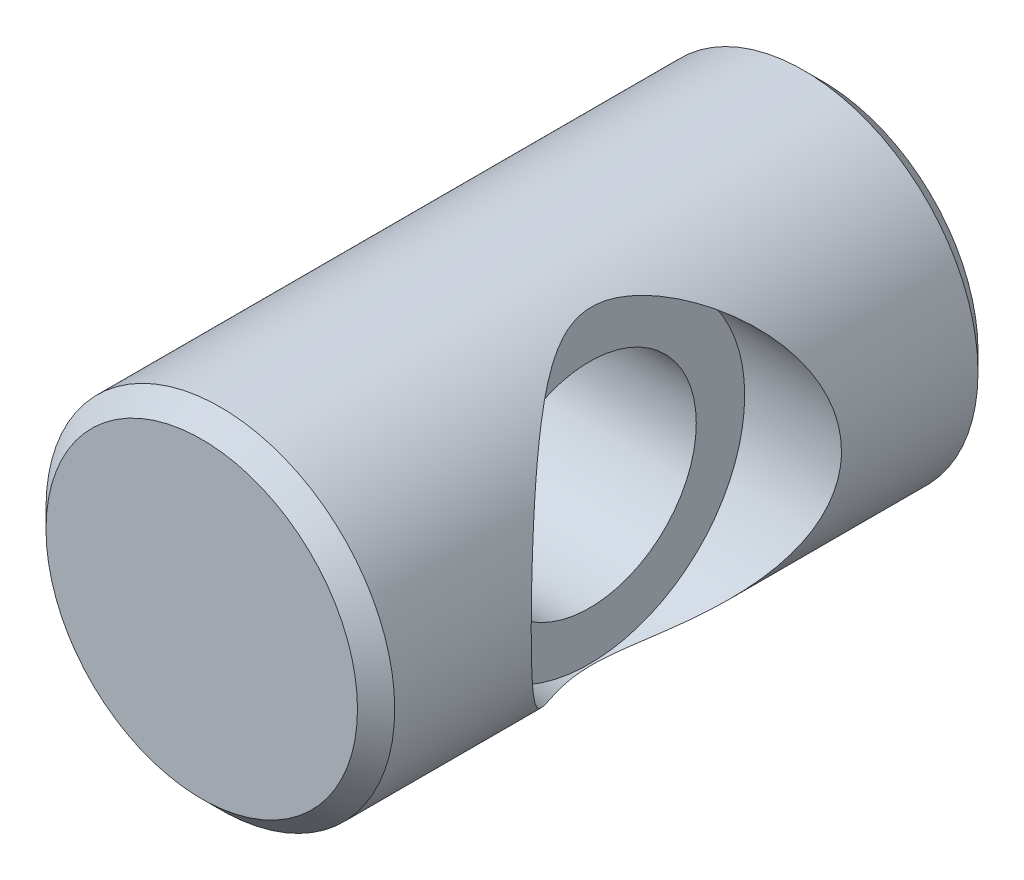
ISO-10303-21;
HEADER;
FILE_DESCRIPTION(('STEP AP214'),'2;1');
FILE_NAME('part.step','',(''),(''),'','','');
FILE_SCHEMA(('AUTOMOTIVE_DESIGN { 1 0 10303 214 1 1 1 1 }'));
ENDSEC;
DATA;
#1=APPLICATION_CONTEXT('core data for automotive mechanical design processes');
#2=APPLICATION_PROTOCOL_DEFINITION('international standard','automotive_design',2000,#1);
#3=PRODUCT_CONTEXT('',#1,'mechanical');
#4=PRODUCT('Part','Part','',(#3));
#5=PRODUCT_RELATED_PRODUCT_CATEGORY('part','',(#4));
#6=PRODUCT_DEFINITION_FORMATION('','',#4);
#7=PRODUCT_DEFINITION_CONTEXT('part definition',#1,'design');
#8=PRODUCT_DEFINITION('design','',#6,#7);
#9=PRODUCT_DEFINITION_SHAPE('','',#8);
#10=(LENGTH_UNIT() NAMED_UNIT(*) SI_UNIT(.MILLI.,.METRE.));
#11=(NAMED_UNIT(*) PLANE_ANGLE_UNIT() SI_UNIT($,.RADIAN.));
#12=(NAMED_UNIT(*) SI_UNIT($,.STERADIAN.) SOLID_ANGLE_UNIT());
#13=UNCERTAINTY_MEASURE_WITH_UNIT(LENGTH_MEASURE(1.E-05),#10,'distance_accuracy_value','');
#14=(GEOMETRIC_REPRESENTATION_CONTEXT(3) GLOBAL_UNCERTAINTY_ASSIGNED_CONTEXT((#13)) GLOBAL_UNIT_ASSIGNED_CONTEXT((#10,
#11,#12)) REPRESENTATION_CONTEXT('',''));
#15=CARTESIAN_POINT('',(0.,0.,0.));
#16=DIRECTION('',(0.,0.,1.));
#17=DIRECTION('',(1.,0.,0.));
#18=AXIS2_PLACEMENT_3D('',#15,#16,#17);
#19=CARTESIAN_POINT('',(0.,0.,12.7));
#20=DIRECTION('',(0.,0.,-1.));
#21=DIRECTION('',(-1.,0.,0.));
#22=AXIS2_PLACEMENT_3D('',#19,#20,#21);
#23=CYLINDRICAL_SURFACE('',#22,7.1374);
#24=CARTESIAN_POINT('',(0.,0.,11.938));
#25=DIRECTION('',(0.,0.,1.));
#26=DIRECTION('',(1.,0.,0.));
#27=AXIS2_PLACEMENT_3D('',#24,#25,#26);
#28=CIRCLE('',#27,7.1374);
#29=CARTESIAN_POINT('',(7.1374,0.,11.938));
#30=VERTEX_POINT('',#29);
#31=EDGE_CURVE('E89',#30,#30,#28,.F.);
#32=ORIENTED_EDGE('',*,*,#31,.T.);
#33=EDGE_LOOP('',(#32));
#34=FACE_BOUND('',#33,.T.);
#35=CARTESIAN_POINT('',(0.,0.,-11.938));
#36=DIRECTION('',(0.,0.,1.));
#37=DIRECTION('',(1.,0.,0.));
#38=AXIS2_PLACEMENT_3D('',#35,#36,#37);
#39=CIRCLE('',#38,7.1374);
#40=CARTESIAN_POINT('',(7.1374,0.,-11.938));
#41=VERTEX_POINT('',#40);
#42=EDGE_CURVE('E92',#41,#41,#39,.T.);
#43=ORIENTED_EDGE('',*,*,#42,.T.);
#44=EDGE_LOOP('',(#43));
#45=FACE_BOUND('',#44,.T.);
#46=CARTESIAN_POINT('',(-7.1374,0.,4.3688));
#47=CARTESIAN_POINT('',(-7.13739926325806,-0.111430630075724,4.36879921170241));
#48=CARTESIAN_POINT('',(-7.13478403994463,-0.222878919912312,4.36453032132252));
#49=CARTESIAN_POINT('',(-7.12438669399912,-0.444927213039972,4.3475124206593));
#50=CARTESIAN_POINT('',(-7.11660192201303,-0.555526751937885,4.33475906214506));
#51=CARTESIAN_POINT('',(-7.09603926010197,-0.775166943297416,4.30091740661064));
#52=CARTESIAN_POINT('',(-7.08325306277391,-0.884204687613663,4.279815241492));
#53=CARTESIAN_POINT('',(-7.05300479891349,-1.09976323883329,4.22956341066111));
#54=CARTESIAN_POINT('',(-7.0355407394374,-1.20628295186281,4.20041031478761));
#55=CARTESIAN_POINT('',(-6.97692189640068,-1.51984647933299,4.10173340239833));
#56=CARTESIAN_POINT('',(-6.9294069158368,-1.72224170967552,4.02077902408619));
#57=CARTESIAN_POINT('',(-6.82142507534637,-2.10979880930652,3.83168041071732));
#58=CARTESIAN_POINT('',(-6.76096055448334,-2.29496378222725,3.72354108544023));
#59=CARTESIAN_POINT('',(-6.62654033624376,-2.6593213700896,3.47374909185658));
#60=CARTESIAN_POINT('',(-6.55189961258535,-2.83691659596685,3.33013791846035));
#61=CARTESIAN_POINT('',(-6.39886499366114,-3.16704970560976,3.0179360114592));
#62=CARTESIAN_POINT('',(-6.32046626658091,-3.31955414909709,2.84931250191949));
#63=CARTESIAN_POINT('',(-6.15672694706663,-3.6151388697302,2.46637660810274));
#64=CARTESIAN_POINT('',(-6.07179226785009,-3.75447742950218,2.24897696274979));
#65=CARTESIAN_POINT('',(-5.91688504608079,-3.99416961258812,1.78885953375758));
#66=CARTESIAN_POINT('',(-5.84688778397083,-4.09458787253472,1.54618458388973));
#67=CARTESIAN_POINT('',(-5.74815230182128,-4.23160691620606,1.10419381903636));
#68=CARTESIAN_POINT('',(-5.71347354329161,-4.27788724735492,0.909212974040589));
#69=CARTESIAN_POINT('',(-5.66392535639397,-4.34329069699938,0.512386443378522));
#70=CARTESIAN_POINT('',(-5.64902972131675,-4.36244974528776,0.310550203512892));
#71=CARTESIAN_POINT('',(-5.64126890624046,-4.37248425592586,-0.0947216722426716));
#72=CARTESIAN_POINT('',(-5.64845360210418,-4.36329568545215,-0.29815989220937));
#73=CARTESIAN_POINT('',(-5.68383016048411,-4.31709944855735,-0.700035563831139));
#74=CARTESIAN_POINT('',(-5.71203835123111,-4.28007015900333,-0.898469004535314));
#75=CARTESIAN_POINT('',(-5.78483926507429,-4.18111909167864,-1.28188424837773));
#76=CARTESIAN_POINT('',(-5.82913703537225,-4.11964364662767,-1.46704052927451));
#77=CARTESIAN_POINT('',(-5.92929954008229,-3.97412459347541,-1.82485398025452));
#78=CARTESIAN_POINT('',(-5.98516843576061,-3.89007286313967,-1.99750662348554));
#79=CARTESIAN_POINT('',(-6.11436811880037,-3.6843267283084,-2.35856047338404));
#80=CARTESIAN_POINT('',(-6.18902987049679,-3.55857441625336,-2.54416749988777));
#81=CARTESIAN_POINT('',(-6.34072132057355,-3.28066897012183,-2.89370006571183));
#82=CARTESIAN_POINT('',(-6.41775330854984,-3.12848960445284,-3.05760377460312));
#83=CARTESIAN_POINT('',(-6.53594550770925,-2.86962657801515,-3.29670389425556));
#84=CARTESIAN_POINT('',(-6.57847668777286,-2.77098301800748,-3.38006303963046));
#85=CARTESIAN_POINT('',(-6.66107998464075,-2.56606243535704,-3.53814479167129));
#86=CARTESIAN_POINT('',(-6.70115302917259,-2.45978832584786,-3.61287066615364));
#87=CARTESIAN_POINT('',(-6.77776807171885,-2.24006284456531,-3.75306802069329));
#88=CARTESIAN_POINT('',(-6.81430940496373,-2.12661012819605,-3.81853775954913));
#89=CARTESIAN_POINT('',(-6.88279796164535,-1.89323624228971,-3.93945740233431));
#90=CARTESIAN_POINT('',(-6.91474801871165,-1.77331912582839,-3.99491349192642));
#91=CARTESIAN_POINT('',(-6.97140079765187,-1.53497962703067,-4.09216716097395));
#92=CARTESIAN_POINT('',(-6.99641848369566,-1.41688139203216,-4.13457466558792));
#93=CARTESIAN_POINT('',(-7.04081739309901,-1.17655725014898,-4.20926915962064));
#94=CARTESIAN_POINT('',(-7.06020182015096,-1.05433373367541,-4.24156190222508));
#95=CARTESIAN_POINT('',(-7.09274558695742,-0.806847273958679,-4.2955136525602));
#96=CARTESIAN_POINT('',(-7.10590996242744,-0.68158687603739,-4.31718126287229));
#97=CARTESIAN_POINT('',(-7.12561096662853,-0.429145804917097,-4.34953245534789));
#98=CARTESIAN_POINT('',(-7.13214862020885,-0.301965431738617,-4.36021773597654));
#99=CARTESIAN_POINT('',(-7.13794134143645,-0.0651494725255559,-4.36968533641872));
#100=CARTESIAN_POINT('',(-7.1381001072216,0.0444082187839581,-4.36994470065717));
#101=CARTESIAN_POINT('',(-7.13338600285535,0.263161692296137,-4.36224027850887));
#102=CARTESIAN_POINT('',(-7.12851158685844,0.372357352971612,-4.35427396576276));
#103=CARTESIAN_POINT('',(-7.11384783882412,0.589470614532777,-4.33022606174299));
#104=CARTESIAN_POINT('',(-7.10406065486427,0.697388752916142,-4.31414801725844));
#105=CARTESIAN_POINT('',(-7.07981255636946,0.911230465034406,-4.27409964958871));
#106=CARTESIAN_POINT('',(-7.06534984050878,1.0171532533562,-4.2501262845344));
#107=CARTESIAN_POINT('',(-7.01646831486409,1.32421326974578,-4.16853283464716));
#108=CARTESIAN_POINT('',(-6.97603776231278,1.52172435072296,-4.10041676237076));
#109=CARTESIAN_POINT('',(-6.88203279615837,1.90227849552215,-3.93835542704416));
#110=CARTESIAN_POINT('',(-6.82845599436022,2.08531892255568,-3.8444054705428));
#111=CARTESIAN_POINT('',(-6.70596969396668,2.45225584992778,-3.62262231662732));
#112=CARTESIAN_POINT('',(-6.6360505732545,2.63430931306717,-3.49230007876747));
#113=CARTESIAN_POINT('',(-6.49034671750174,2.97529044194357,-3.20680766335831));
#114=CARTESIAN_POINT('',(-6.41455531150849,3.13419119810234,-3.0516090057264));
#115=CARTESIAN_POINT('',(-6.25266900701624,3.44698224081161,-2.69597729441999));
#116=CARTESIAN_POINT('',(-6.16659291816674,3.5971673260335,-2.49225811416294));
#117=CARTESIAN_POINT('',(-6.00460677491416,3.86150634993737,-2.05898797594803));
#118=CARTESIAN_POINT('',(-5.92868769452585,3.97569240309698,-1.82946029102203));
#119=CARTESIAN_POINT('',(-5.81234039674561,4.14334349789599,-1.4000867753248));
#120=CARTESIAN_POINT('',(-5.76779379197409,4.20457409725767,-1.20440352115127));
#121=CARTESIAN_POINT('',(-5.69758785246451,4.29924496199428,-0.80326067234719));
#122=CARTESIAN_POINT('',(-5.67190057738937,4.33272634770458,-0.597816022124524));
#123=CARTESIAN_POINT('',(-5.64321310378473,4.37003861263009,-0.181630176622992));
#124=CARTESIAN_POINT('',(-5.64031853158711,4.37373144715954,0.0291311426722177));
#125=CARTESIAN_POINT('',(-5.65799816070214,4.35082899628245,0.448046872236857));
#126=CARTESIAN_POINT('',(-5.67858319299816,4.32421973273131,0.656200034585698));
#127=CARTESIAN_POINT('',(-5.73795877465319,4.24505718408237,1.05064162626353));
#128=CARTESIAN_POINT('',(-5.77551626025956,4.19425020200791,1.2374804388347));
#129=CARTESIAN_POINT('',(-5.86388187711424,4.06978791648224,1.60000573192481));
#130=CARTESIAN_POINT('',(-5.91469515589,3.99612373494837,1.77568784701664));
#131=CARTESIAN_POINT('',(-6.03314781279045,3.8153536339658,2.13931949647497));
#132=CARTESIAN_POINT('',(-6.10216834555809,3.70488500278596,2.32514235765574));
#133=CARTESIAN_POINT('',(-6.24489624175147,3.45890667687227,2.67743124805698));
#134=CARTESIAN_POINT('',(-6.31860745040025,3.32337625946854,2.84388107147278));
#135=CARTESIAN_POINT('',(-6.47808979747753,3.00238753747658,3.18370728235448));
#136=CARTESIAN_POINT('',(-6.56364043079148,2.8123331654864,3.35292631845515));
#137=CARTESIAN_POINT('',(-6.68412541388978,2.50541943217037,3.58128590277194));
#138=CARTESIAN_POINT('',(-6.72301072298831,2.39937413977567,3.65321251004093));
#139=CARTESIAN_POINT('',(-6.79715906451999,2.1804647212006,3.78793859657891));
#140=CARTESIAN_POINT('',(-6.83242407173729,2.06760436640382,3.85074305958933));
#141=CARTESIAN_POINT('',(-6.89785133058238,1.83745076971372,3.96566288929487));
#142=CARTESIAN_POINT('',(-6.92808339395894,1.72025176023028,4.01792708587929));
#143=CARTESIAN_POINT('',(-6.98320798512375,1.48066798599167,4.11224920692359));
#144=CARTESIAN_POINT('',(-7.00810362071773,1.35828628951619,4.15431307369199));
#145=CARTESIAN_POINT('',(-7.0517460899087,1.10961591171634,4.22751922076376));
#146=CARTESIAN_POINT('',(-7.07051025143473,0.983339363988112,4.25869229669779));
#147=CARTESIAN_POINT('',(-7.10136144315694,0.727791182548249,4.30971981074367));
#148=CARTESIAN_POINT('',(-7.11345373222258,0.598521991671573,4.32958316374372));
#149=CARTESIAN_POINT('',(-7.12712117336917,0.390761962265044,4.35199151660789));
#150=CARTESIAN_POINT('',(-7.1309708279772,0.312801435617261,4.35828981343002));
#151=CARTESIAN_POINT('',(-7.13611056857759,0.156563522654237,4.36669444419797));
#152=CARTESIAN_POINT('',(-7.13740051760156,0.0782861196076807,4.36880055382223));
#153=CARTESIAN_POINT('',(-7.1374,0.,4.3688));
#154=B_SPLINE_CURVE_WITH_KNOTS('',3,(#46,#47,#48,#49,#50,#51,#52,#53,#54,#55,#56,#57,#58,#59,
#60,#61,#62,#63,#64,#65,#66,#67,#68,#69,#70,#71,#72,#73,#74,#75,#76,#77,#78,#79,#80,#81,#82,#83,
#84,#85,#86,#87,#88,#89,#90,#91,#92,#93,#94,#95,#96,#97,#98,#99,#100,#101,#102,#103,#104,#105,
#106,#107,#108,#109,#110,#111,#112,#113,#114,#115,#116,#117,#118,#119,#120,#121,#122,#123,#124,
#125,#126,#127,#128,#129,#130,#131,#132,#133,#134,#135,#136,#137,#138,#139,#140,#141,#142,#143,
#144,#145,#146,#147,#148,#149,#150,#151,#152,#153),.UNSPECIFIED.,.T.,.F.,(4,2,2,2,2,2,2,2,2,2,2,
2,2,2,2,2,2,2,2,2,2,2,2,2,2,2,2,2,2,2,2,2,2,2,2,2,2,2,2,2,2,2,2,2,2,2,2,2,2,2,2,2,2,4),(0.,
0.334210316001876,0.668592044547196,1.00353155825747,1.33861399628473,2.00472075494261,
2.67070729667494,3.3887362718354,4.10771459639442,4.91926664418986,5.7294650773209,
6.33703528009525,6.94379982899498,7.55193596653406,8.1605449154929,8.75851775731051,
9.35670601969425,10.0630177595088,10.7700346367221,11.1775127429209,11.5848361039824,
11.992235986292,12.3993833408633,12.7826735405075,13.165745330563,13.5485064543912,
13.931208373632,14.2594681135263,14.5878287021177,14.9160458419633,15.2443895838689,
15.8798983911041,16.5155227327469,17.2164321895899,17.9181498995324,18.716527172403,
19.5141901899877,20.1411179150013,20.7671149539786,21.3960113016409,22.0251978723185,
22.6146121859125,23.2042557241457,23.882548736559,24.5614051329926,25.3625985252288,
25.763895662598,26.1649727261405,26.5599138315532,26.9546243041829,27.3482094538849,
27.7414839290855,27.9762724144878,28.2110734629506),.UNSPECIFIED.);
#155=CARTESIAN_POINT('',(-7.1374,0.,4.3688));
#156=VERTEX_POINT('',#155);
#157=EDGE_CURVE('E41',#156,#156,#154,.T.);
#158=ORIENTED_EDGE('',*,*,#157,.T.);
#159=EDGE_LOOP('',(#158));
#160=FACE_BOUND('',#159,.T.);
#161=CARTESIAN_POINT('',(7.1374,0.,6.35));
#162=CARTESIAN_POINT('',(7.13739876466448,-0.147620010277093,6.34999874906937));
#163=CARTESIAN_POINT('',(7.13281010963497,-0.295262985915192,6.34484230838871));
#164=CARTESIAN_POINT('',(7.11455464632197,-0.589334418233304,6.32431265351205));
#165=CARTESIAN_POINT('',(7.10088293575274,-0.73576217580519,6.30893392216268));
#166=CARTESIAN_POINT('',(7.06473743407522,-1.02637136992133,6.26822336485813));
#167=CARTESIAN_POINT('',(7.04224908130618,-1.17054867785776,6.24287507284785));
#168=CARTESIAN_POINT('',(6.98894287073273,-1.4553925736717,6.18268055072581));
#169=CARTESIAN_POINT('',(6.95812110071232,-1.59605747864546,6.14782985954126));
#170=CARTESIAN_POINT('',(6.88901812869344,-1.8718887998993,6.06950822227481));
#171=CARTESIAN_POINT('',(6.85079387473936,-2.00708822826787,6.02610304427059));
#172=CARTESIAN_POINT('',(6.7674199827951,-2.27241716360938,5.93114720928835));
#173=CARTESIAN_POINT('',(6.72226730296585,-2.40254441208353,5.87959297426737));
#174=CARTESIAN_POINT('',(6.57751191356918,-2.78437509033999,5.71372273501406));
#175=CARTESIAN_POINT('',(6.46854341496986,-3.02779231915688,5.58812218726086));
#176=CARTESIAN_POINT('',(6.26756942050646,-3.41948638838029,5.35395838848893));
#177=CARTESIAN_POINT('',(6.18042092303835,-3.57425087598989,5.25175506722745));
#178=CARTESIAN_POINT('',(5.99868531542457,-3.87150538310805,5.03662253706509));
#179=CARTESIAN_POINT('',(5.90409801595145,-4.01399509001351,4.92369305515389));
#180=CARTESIAN_POINT('',(5.70901937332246,-4.28693376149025,4.6879967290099));
#181=CARTESIAN_POINT('',(5.60851425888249,-4.41735266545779,4.56520667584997));
#182=CARTESIAN_POINT('',(5.40351880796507,-4.66587598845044,4.31088239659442));
#183=CARTESIAN_POINT('',(5.29902900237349,-4.78398204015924,4.17934933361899));
#184=CARTESIAN_POINT('',(5.08539551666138,-5.01059065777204,3.9049788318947));
#185=CARTESIAN_POINT('',(4.97620002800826,-5.11881590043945,3.76195311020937));
#186=CARTESIAN_POINT('',(4.75744105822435,-5.32274271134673,3.46742125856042));
#187=CARTESIAN_POINT('',(4.64787747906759,-5.41844061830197,3.31591266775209));
#188=CARTESIAN_POINT('',(4.43107203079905,-5.59712069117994,3.00448360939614));
#189=CARTESIAN_POINT('',(4.3238262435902,-5.6801260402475,2.84457921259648));
#190=CARTESIAN_POINT('',(4.11477697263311,-5.83333959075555,2.51546828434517));
#191=CARTESIAN_POINT('',(4.01296974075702,-5.90355668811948,2.34626832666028));
#192=CARTESIAN_POINT('',(3.81848747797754,-6.03119062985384,1.99559879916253));
#193=CARTESIAN_POINT('',(3.72590887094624,-6.08847892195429,1.81402754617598));
#194=CARTESIAN_POINT('',(3.55841845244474,-6.18785972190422,1.43889571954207));
#195=CARTESIAN_POINT('',(3.48348141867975,-6.22997397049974,1.24535276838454));
#196=CARTESIAN_POINT('',(3.37167556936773,-6.29108197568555,0.879335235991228));
#197=CARTESIAN_POINT('',(3.33056517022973,-6.31274439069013,0.70865514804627));
#198=CARTESIAN_POINT('',(3.27444959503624,-6.3420450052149,0.362001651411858));
#199=CARTESIAN_POINT('',(3.25938666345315,-6.34971423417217,0.186040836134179));
#200=CARTESIAN_POINT('',(3.25830440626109,-6.35027073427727,-0.166494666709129));
#201=CARTESIAN_POINT('',(3.27236800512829,-6.34311580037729,-0.343069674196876));
#202=CARTESIAN_POINT('',(3.32682908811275,-6.31470835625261,-0.691090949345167));
#203=CARTESIAN_POINT('',(3.36728310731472,-6.293425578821,-0.86252537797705));
#204=CARTESIAN_POINT('',(3.45568072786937,-6.24520640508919,-1.15598941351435));
#205=CARTESIAN_POINT('',(3.49935461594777,-6.22093647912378,-1.27982459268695));
#206=CARTESIAN_POINT('',(3.595296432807,-6.16598571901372,-1.52270256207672));
#207=CARTESIAN_POINT('',(3.64756969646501,-6.13530090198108,-1.64174231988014));
#208=CARTESIAN_POINT('',(3.75856141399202,-6.06794198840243,-1.87548146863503));
#209=CARTESIAN_POINT('',(3.81730041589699,-6.03124860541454,-1.99016536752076));
#210=CARTESIAN_POINT('',(3.93928603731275,-5.95229351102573,-2.21515487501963));
#211=CARTESIAN_POINT('',(4.00253427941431,-5.91002979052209,-2.3254588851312));
#212=CARTESIAN_POINT('',(4.18078734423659,-5.7864061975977,-2.62339918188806));
#213=CARTESIAN_POINT('',(4.29897126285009,-5.69953206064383,-2.80686361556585));
#214=CARTESIAN_POINT('',(4.53936837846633,-5.51000260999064,-3.16275382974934));
#215=CARTESIAN_POINT('',(4.66158425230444,-5.40733663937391,-3.33517204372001));
#216=CARTESIAN_POINT('',(4.90624682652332,-5.18636542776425,-3.6693605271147));
#217=CARTESIAN_POINT('',(5.02869339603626,-5.06806734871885,-3.83113562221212));
#218=CARTESIAN_POINT('',(5.270889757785,-4.81568203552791,-4.14391911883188));
#219=CARTESIAN_POINT('',(5.39064071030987,-4.68160175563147,-4.29493221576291));
#220=CARTESIAN_POINT('',(5.60292447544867,-4.4240358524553,-4.55824969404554));
#221=CARTESIAN_POINT('',(5.69634947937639,-4.30328021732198,-4.67250167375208));
#222=CARTESIAN_POINT('',(5.87838071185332,-4.05109205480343,-4.89277218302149));
#223=CARTESIAN_POINT('',(5.96698576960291,-3.9196569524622,-4.99878871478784));
#224=CARTESIAN_POINT('',(6.22315124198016,-3.50974788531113,-5.30279179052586));
#225=CARTESIAN_POINT('',(6.38160503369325,-3.21503076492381,-5.48739550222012));
#226=CARTESIAN_POINT('',(6.63204370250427,-2.65184233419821,-5.77650546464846));
#227=CARTESIAN_POINT('',(6.7309989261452,-2.39097113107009,-5.88969390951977));
#228=CARTESIAN_POINT('',(6.85760721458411,-1.98392745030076,-6.03384771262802));
#229=CARTESIAN_POINT('',(6.896180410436,-1.84558185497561,-6.07763630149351));
#230=CARTESIAN_POINT('',(6.96534900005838,-1.56439138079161,-6.15600921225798));
#231=CARTESIAN_POINT('',(6.99594785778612,-1.42154848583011,-6.19059753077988));
#232=CARTESIAN_POINT('',(7.04872964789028,-1.1312832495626,-6.2501842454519));
#233=CARTESIAN_POINT('',(7.07085321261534,-0.983836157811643,-6.27511500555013));
#234=CARTESIAN_POINT('',(7.10588886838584,-0.686462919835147,-6.31456731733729));
#235=CARTESIAN_POINT('',(7.11880093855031,-0.536536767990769,-6.32908884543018));
#236=CARTESIAN_POINT('',(7.13510289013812,-0.235564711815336,-6.34741932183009));
#237=CARTESIAN_POINT('',(7.13849604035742,-0.0845192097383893,-6.35123194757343));
#238=CARTESIAN_POINT('',(7.13568582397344,0.217361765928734,-6.34807326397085));
#239=CARTESIAN_POINT('',(7.12948322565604,0.368197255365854,-6.3411028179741));
#240=CARTESIAN_POINT('',(7.10878875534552,0.652476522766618,-6.31782583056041));
#241=CARTESIAN_POINT('',(7.09523903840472,0.786078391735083,-6.3025802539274));
#242=CARTESIAN_POINT('',(7.06083548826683,1.05116656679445,-6.26382460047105));
#243=CARTESIAN_POINT('',(7.03997925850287,1.18265216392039,-6.24031181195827));
#244=CARTESIAN_POINT('',(6.99133878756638,1.44261523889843,-6.18538619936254));
#245=CARTESIAN_POINT('',(6.96355641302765,1.57109351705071,-6.15397550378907));
#246=CARTESIAN_POINT('',(6.90152346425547,1.82441455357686,-6.08369277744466));
#247=CARTESIAN_POINT('',(6.86727044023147,1.94925591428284,-6.04481792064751));
#248=CARTESIAN_POINT('',(6.75240358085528,2.32784464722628,-5.91411626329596));
#249=CARTESIAN_POINT('',(6.66178016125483,2.57464927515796,-5.81056555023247));
#250=CARTESIAN_POINT('',(6.4597208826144,3.04639382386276,-5.57775630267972));
#251=CARTESIAN_POINT('',(6.34827764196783,3.27132594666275,-5.44848864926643));
#252=CARTESIAN_POINT('',(6.13882808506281,3.64573100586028,-5.20271887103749));
#253=CARTESIAN_POINT('',(6.04420707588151,3.80020003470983,-5.09083370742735));
#254=CARTESIAN_POINT('',(5.84792511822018,4.09581838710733,-4.85617051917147));
#255=CARTESIAN_POINT('',(5.7462635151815,4.23696646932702,-4.73339148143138));
#256=CARTESIAN_POINT('',(5.53747555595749,4.50643950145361,-4.47762651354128));
#257=CARTESIAN_POINT('',(5.43033159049,4.63471863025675,-4.3446068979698));
#258=CARTESIAN_POINT('',(5.21284023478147,4.87805218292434,-4.06949979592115));
#259=CARTESIAN_POINT('',(5.10249347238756,4.99310917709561,-3.92741408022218));
#260=CARTESIAN_POINT('',(4.8780682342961,5.21268894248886,-3.63113755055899));
#261=CARTESIAN_POINT('',(4.76396222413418,5.31690948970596,-3.47674380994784));
#262=CARTESIAN_POINT('',(4.53700073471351,5.51184866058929,-3.15861578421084));
#263=CARTESIAN_POINT('',(4.4241459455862,5.60256014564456,-2.9948766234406));
#264=CARTESIAN_POINT('',(4.20344055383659,5.76997987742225,-2.6580282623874));
#265=CARTESIAN_POINT('',(4.09557486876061,5.84673271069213,-2.48495127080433));
#266=CARTESIAN_POINT('',(3.88930317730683,5.98591863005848,-2.12789625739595));
#267=CARTESIAN_POINT('',(3.79088531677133,6.04836980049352,-1.94393237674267));
#268=CARTESIAN_POINT('',(3.6199560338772,6.15201808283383,-1.58324118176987));
#269=CARTESIAN_POINT('',(3.54581575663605,6.19474873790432,-1.40774574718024));
#270=CARTESIAN_POINT('',(3.41860775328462,6.26585798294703,-1.04649166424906));
#271=CARTESIAN_POINT('',(3.36548855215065,6.29427167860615,-0.860759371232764));
#272=CARTESIAN_POINT('',(3.3077942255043,6.32466982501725,-0.574869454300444));
#273=CARTESIAN_POINT('',(3.2921927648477,6.33277989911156,-0.477544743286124));
#274=CARTESIAN_POINT('',(3.26953292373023,6.34450967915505,-0.281618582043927));
#275=CARTESIAN_POINT('',(3.26247328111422,6.34813004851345,-0.18301732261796));
#276=CARTESIAN_POINT('',(3.25736862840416,6.35075086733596,0.0144246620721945));
#277=CARTESIAN_POINT('',(3.2593184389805,6.34975397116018,0.11326521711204));
#278=CARTESIAN_POINT('',(3.27208667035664,6.34318352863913,0.310217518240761));
#279=CARTESIAN_POINT('',(3.28290619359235,6.3376094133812,0.408329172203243));
#280=CARTESIAN_POINT('',(3.3135977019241,6.32161851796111,0.608518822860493));
#281=CARTESIAN_POINT('',(3.33395404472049,6.31094192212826,0.710500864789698));
#282=CARTESIAN_POINT('',(3.38261947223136,6.28499215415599,0.911980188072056));
#283=CARTESIAN_POINT('',(3.41093434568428,6.26971563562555,1.01147560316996));
#284=CARTESIAN_POINT('',(3.50590864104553,6.21741611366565,1.30618929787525));
#285=CARTESIAN_POINT('',(3.58250026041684,6.17397013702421,1.49708619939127));
#286=CARTESIAN_POINT('',(3.74250029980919,6.0781480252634,1.84597377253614));
#287=CARTESIAN_POINT('',(3.82416625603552,6.02733122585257,2.00524775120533));
#288=CARTESIAN_POINT('',(3.99564584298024,5.91504934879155,2.31557927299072));
#289=CARTESIAN_POINT('',(4.08546601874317,5.85357568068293,2.46663005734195));
#290=CARTESIAN_POINT('',(4.26990438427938,5.72043401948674,2.76140011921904));
#291=CARTESIAN_POINT('',(4.36452933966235,5.64875137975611,2.90510845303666));
#292=CARTESIAN_POINT('',(4.55598976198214,5.49549619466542,3.18551926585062));
#293=CARTESIAN_POINT('',(4.652824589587,5.41392648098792,3.32222373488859));
#294=CARTESIAN_POINT('',(4.85688820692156,5.23198622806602,3.60271753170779));
#295=CARTESIAN_POINT('',(4.96415874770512,5.13054426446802,3.74578298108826));
#296=CARTESIAN_POINT('',(5.17714697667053,4.91554120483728,4.02378372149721));
#297=CARTESIAN_POINT('',(5.28286440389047,4.80197809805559,4.15871765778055));
#298=CARTESIAN_POINT('',(5.49078838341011,4.56276006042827,4.41984162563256));
#299=CARTESIAN_POINT('',(5.593000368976,4.43712510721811,4.5460455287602));
#300=CARTESIAN_POINT('',(5.79237640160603,4.17351429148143,4.7892042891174));
#301=CARTESIAN_POINT('',(5.88953947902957,4.03553607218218,4.90615737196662));
#302=CARTESIAN_POINT('',(6.13794854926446,3.65352792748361,5.20236126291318));
#303=CARTESIAN_POINT('',(6.28348700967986,3.39866762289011,5.3729289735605));
#304=CARTESIAN_POINT('',(6.48162005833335,2.992302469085,5.60293682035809));
#305=CARTESIAN_POINT('',(6.54430975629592,2.85281252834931,5.67530761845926));
#306=CARTESIAN_POINT('',(6.66193935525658,2.56612643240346,5.81055763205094));
#307=CARTESIAN_POINT('',(6.71688078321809,2.41893180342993,5.8734387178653));
#308=CARTESIAN_POINT('',(6.80989232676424,2.14143581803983,5.97956496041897));
#309=CARTESIAN_POINT('',(6.8492563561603,2.01215125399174,6.02434273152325));
#310=CARTESIAN_POINT('',(6.92107599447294,1.74921312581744,6.10587317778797));
#311=CARTESIAN_POINT('',(6.95353294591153,1.61556041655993,6.14262741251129));
#312=CARTESIAN_POINT('',(7.01090991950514,1.34488728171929,6.20750414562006));
#313=CARTESIAN_POINT('',(7.0358453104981,1.20787435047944,6.23564424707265));
#314=CARTESIAN_POINT('',(7.07778142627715,0.931157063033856,6.28292374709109));
#315=CARTESIAN_POINT('',(7.09478593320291,0.791454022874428,6.30206743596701));
#316=CARTESIAN_POINT('',(7.11753061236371,0.5431056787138,6.32766056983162));
#317=CARTESIAN_POINT('',(7.1249721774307,0.434807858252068,6.33602843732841));
#318=CARTESIAN_POINT('',(7.13490782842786,0.217677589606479,6.34719917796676));
#319=CARTESIAN_POINT('',(7.13740091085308,0.10884503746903,6.35000092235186));
#320=CARTESIAN_POINT('',(7.1374,0.,6.35));
#321=B_SPLINE_CURVE_WITH_KNOTS('',3,(#161,#162,#163,#164,#165,#166,#167,#168,#169,#170,#171,
#172,#173,#174,#175,#176,#177,#178,#179,#180,#181,#182,#183,#184,#185,#186,#187,#188,#189,#190,
#191,#192,#193,#194,#195,#196,#197,#198,#199,#200,#201,#202,#203,#204,#205,#206,#207,#208,#209,
#210,#211,#212,#213,#214,#215,#216,#217,#218,#219,#220,#221,#222,#223,#224,#225,#226,#227,#228,
#229,#230,#231,#232,#233,#234,#235,#236,#237,#238,#239,#240,#241,#242,#243,#244,#245,#246,#247,
#248,#249,#250,#251,#252,#253,#254,#255,#256,#257,#258,#259,#260,#261,#262,#263,#264,#265,#266,
#267,#268,#269,#270,#271,#272,#273,#274,#275,#276,#277,#278,#279,#280,#281,#282,#283,#284,#285,
#286,#287,#288,#289,#290,#291,#292,#293,#294,#295,#296,#297,#298,#299,#300,#301,#302,#303,#304,
#305,#306,#307,#308,#309,#310,#311,#312,#313,#314,#315,#316,#317,#318,#319,#320),.UNSPECIFIED.,
.T.,.F.,(4,2,2,2,2,2,2,2,2,2,2,2,2,2,2,2,2,2,2,2,2,2,2,2,2,2,2,2,2,2,2,2,2,2,2,2,2,2,2,2,2,2,2,
2,2,2,2,2,2,2,2,2,2,2,2,2,2,2,2,2,2,2,2,2,2,2,2,2,2,2,2,2,2,2,2,2,2,2,2,4),(0.,
0.442740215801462,0.885719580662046,1.32943367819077,1.77335644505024,2.21399079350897,
2.65481915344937,3.53563240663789,4.1496939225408,4.76377107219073,5.37933851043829,
5.9948242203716,6.62421828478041,7.25379588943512,7.88220946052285,8.51018420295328,
9.14415192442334,9.77720767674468,10.3057860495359,10.8331908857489,11.3620993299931,
11.8921445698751,12.2922023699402,12.6925093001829,13.0941272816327,13.4958905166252,
14.1995453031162,14.9036770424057,15.6074872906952,16.3109885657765,16.8825350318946,
17.4542197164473,18.5944133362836,19.4938301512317,19.9437943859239,20.3935628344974,
20.8464265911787,21.2992913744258,21.7520006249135,22.2046736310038,22.6096556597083,
23.0147706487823,23.4197765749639,23.8249361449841,24.6692351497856,25.5138340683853,
26.1517531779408,26.7897316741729,27.429906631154,28.0699569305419,28.7246908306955,
29.3797694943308,30.0327174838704,30.6848352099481,31.2692435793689,31.8522118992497,
32.1485005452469,32.4447454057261,32.7408199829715,33.0369313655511,33.3500544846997,
33.6634059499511,34.2917657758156,34.8492729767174,35.4072316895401,35.9659991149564,
36.5246068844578,37.1408391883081,37.757173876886,38.3725056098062,38.9879550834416,
40.001822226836,40.5089060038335,41.015889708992,41.4425758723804,41.8691790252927,
42.2949044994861,42.720426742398,43.0468073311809,43.3732541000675),.UNSPECIFIED.);
#322=CARTESIAN_POINT('',(7.1374,0.,6.35));
#323=VERTEX_POINT('',#322);
#324=EDGE_CURVE('E10',#323,#323,#321,.T.);
#325=ORIENTED_EDGE('',*,*,#324,.F.);
#326=EDGE_LOOP('',(#325));
#327=FACE_BOUND('',#326,.T.);
#328=ADVANCED_FACE('F30',(#34,#45,#160,#327),#23,.T.);
#329=CARTESIAN_POINT('',(-7.1374,0.,0.));
#330=DIRECTION('',(1.,0.,0.));
#331=DIRECTION('',(0.,0.,-1.));
#332=AXIS2_PLACEMENT_3D('',#329,#330,#331);
#333=CYLINDRICAL_SURFACE('',#332,4.3688);
#334=ORIENTED_EDGE('',*,*,#157,.F.);
#335=EDGE_LOOP('',(#334));
#336=FACE_BOUND('',#335,.T.);
#337=CARTESIAN_POINT('',(3.175,0.,0.));
#338=DIRECTION('',(1.,0.,0.));
#339=DIRECTION('',(0.,0.,-1.));
#340=AXIS2_PLACEMENT_3D('',#337,#338,#339);
#341=CIRCLE('',#340,4.3688);
#342=CARTESIAN_POINT('',(3.175,0.,-4.3688));
#343=VERTEX_POINT('',#342);
#344=EDGE_CURVE('E57',#343,#343,#341,.F.);
#345=ORIENTED_EDGE('',*,*,#344,.F.);
#346=EDGE_LOOP('',(#345));
#347=FACE_BOUND('',#346,.T.);
#348=ADVANCED_FACE('F58',(#336,#347),#333,.F.);
#349=CARTESIAN_POINT('',(0.,0.,12.7));
#350=DIRECTION('',(0.,0.,1.));
#351=DIRECTION('',(1.,0.,0.));
#352=AXIS2_PLACEMENT_3D('',#349,#350,#351);
#353=PLANE('',#352);
#354=CARTESIAN_POINT('',(0.,0.,12.7));
#355=DIRECTION('',(0.,0.,1.));
#356=DIRECTION('',(1.,0.,0.));
#357=AXIS2_PLACEMENT_3D('',#354,#355,#356);
#358=CIRCLE('',#357,6.37539999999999);
#359=CARTESIAN_POINT('',(6.37539999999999,0.,12.7));
#360=VERTEX_POINT('',#359);
#361=EDGE_CURVE('E45',#360,#360,#358,.T.);
#362=ORIENTED_EDGE('',*,*,#361,.T.);
#363=EDGE_LOOP('',(#362));
#364=FACE_BOUND('',#363,.T.);
#365=ADVANCED_FACE('F62',(#364),#353,.T.);
#366=CARTESIAN_POINT('',(0.,0.,-12.7));
#367=DIRECTION('',(0.,0.,1.));
#368=DIRECTION('',(1.,0.,0.));
#369=AXIS2_PLACEMENT_3D('',#366,#367,#368);
#370=PLANE('',#369);
#371=CARTESIAN_POINT('',(0.,0.,-12.7));
#372=DIRECTION('',(0.,0.,1.));
#373=DIRECTION('',(1.,0.,0.));
#374=AXIS2_PLACEMENT_3D('',#371,#372,#373);
#375=CIRCLE('',#374,6.37539999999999);
#376=CARTESIAN_POINT('',(6.37539999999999,0.,-12.7));
#377=VERTEX_POINT('',#376);
#378=EDGE_CURVE('E50',#377,#377,#375,.F.);
#379=ORIENTED_EDGE('',*,*,#378,.T.);
#380=EDGE_LOOP('',(#379));
#381=FACE_BOUND('',#380,.T.);
#382=ADVANCED_FACE('F74',(#381),#370,.F.);
#383=CARTESIAN_POINT('',(0.,0.,-11.938));
#384=DIRECTION('',(0.,0.,1.));
#385=DIRECTION('',(1.,0.,0.));
#386=AXIS2_PLACEMENT_3D('',#383,#384,#385);
#387=CONICAL_SURFACE('',#386,7.1374,0.785398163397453);
#388=ORIENTED_EDGE('',*,*,#378,.F.);
#389=EDGE_LOOP('',(#388));
#390=FACE_BOUND('',#389,.T.);
#391=ORIENTED_EDGE('',*,*,#42,.F.);
#392=EDGE_LOOP('',(#391));
#393=FACE_BOUND('',#392,.T.);
#394=ADVANCED_FACE('F70',(#390,#393),#387,.T.);
#395=CARTESIAN_POINT('',(0.,0.,12.7));
#396=DIRECTION('',(0.,0.,-1.));
#397=DIRECTION('',(-1.,0.,0.));
#398=AXIS2_PLACEMENT_3D('',#395,#396,#397);
#399=CONICAL_SURFACE('',#398,6.37539999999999,0.785398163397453);
#400=ORIENTED_EDGE('',*,*,#31,.F.);
#401=EDGE_LOOP('',(#400));
#402=FACE_BOUND('',#401,.T.);
#403=ORIENTED_EDGE('',*,*,#361,.F.);
#404=EDGE_LOOP('',(#403));
#405=FACE_BOUND('',#404,.T.);
#406=ADVANCED_FACE('F67',(#402,#405),#399,.T.);
#407=CARTESIAN_POINT('',(7.1374,0.,0.));
#408=DIRECTION('',(-1.,0.,0.));
#409=DIRECTION('',(0.,0.,1.));
#410=AXIS2_PLACEMENT_3D('',#407,#408,#409);
#411=CYLINDRICAL_SURFACE('',#410,6.35);
#412=CARTESIAN_POINT('',(3.175,0.,0.));
#413=DIRECTION('',(1.,0.,0.));
#414=DIRECTION('',(0.,0.,-1.));
#415=AXIS2_PLACEMENT_3D('',#412,#413,#414);
#416=CIRCLE('',#415,6.35);
#417=CARTESIAN_POINT('',(3.175,0.,-6.35));
#418=VERTEX_POINT('',#417);
#419=EDGE_CURVE('E99',#418,#418,#416,.T.);
#420=ORIENTED_EDGE('',*,*,#419,.F.);
#421=EDGE_LOOP('',(#420));
#422=FACE_BOUND('',#421,.T.);
#423=ORIENTED_EDGE('',*,*,#324,.T.);
#424=EDGE_LOOP('',(#423));
#425=FACE_BOUND('',#424,.T.);
#426=ADVANCED_FACE('F64',(#422,#425),#411,.F.);
#427=CARTESIAN_POINT('',(3.175,0.,0.));
#428=DIRECTION('',(1.,0.,0.));
#429=DIRECTION('',(0.,0.,-1.));
#430=AXIS2_PLACEMENT_3D('',#427,#428,#429);
#431=PLANE('',#430);
#432=ORIENTED_EDGE('',*,*,#419,.T.);
#433=EDGE_LOOP('',(#432));
#434=FACE_BOUND('',#433,.T.);
#435=ORIENTED_EDGE('',*,*,#344,.T.);
#436=EDGE_LOOP('',(#435));
#437=FACE_BOUND('',#436,.T.);
#438=ADVANCED_FACE('F106',(#434,#437),#431,.T.);
#439=CLOSED_SHELL('',(#328,#348,#365,#382,#394,#406,#426,#438));
#440=MANIFOLD_SOLID_BREP('B2',#439);
#441=ADVANCED_BREP_SHAPE_REPRESENTATION('',(#18,#440),#14);
#442=SHAPE_DEFINITION_REPRESENTATION(#9,#441);
ENDSEC;
END-ISO-10303-21;
